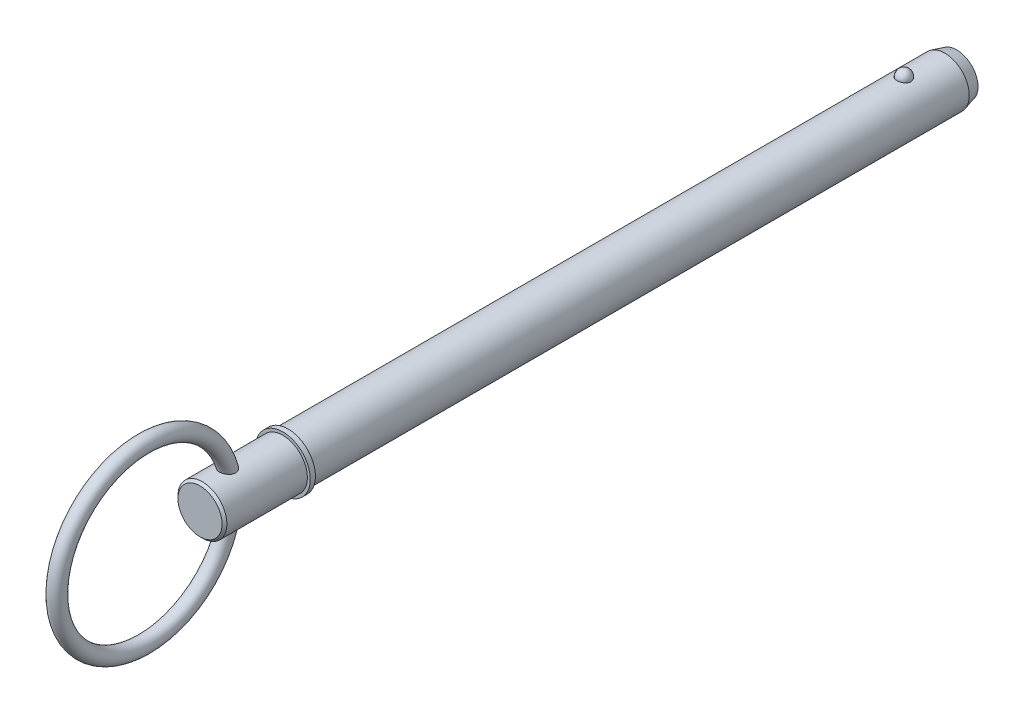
from build123d import *

# Parameters (mm, degrees)
SKETCH2_R           = 7.145
BOSS_EXTRUDE1_DEPTH = 177.8
BOSS_EXTRUDE2_START = 17.45
SKETCH3_R           = 7.145
BOSS_EXTRUDE2_DEPTH = 17.45
CHAMFER1_SIZE       = 3.5
CHAMFER1_SIZE2      = 0.937822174
SKETCH20_W          = 1.5
SKETCH20_H          = 8
SKETCH21_R          = 7.145
BOSS_EXTRUDE3_DEPTH = 25.7
CHAMFER2_SIZE       = 0.7
SKETCH24_R          = 2.25


with BuildPart() as part:
    # Sketch2 → Boss-Extrude1 (new body)
    with BuildSketch(Plane.XY):
        Circle(SKETCH2_R)
    extrude(amount=BOSS_EXTRUDE1_DEPTH)

    # Sketch3 → Boss-Extrude2 (add)
    with BuildSketch(Plane(origin=(0, 0, 0), x_dir=(-1, 0, 0), z_dir=(0, 0, -1)).offset(BOSS_EXTRUDE2_START)):
        Circle(SKETCH3_R)
    extrude(amount=-BOSS_EXTRUDE2_DEPTH)

    # Chamfer1
    chamfer1_edges = [part.edges().sort_by_distance(p)[0] for p in [
        (7.145, 0, -17.45),
    ]]
    chamfer1_side = [part.faces().sort_by_distance(p)[0] for p in [
        (7.145, 0, -8.725),
    ]]
    chamfer(chamfer1_edges, length=CHAMFER1_SIZE, length2=CHAMFER1_SIZE2, reference=chamfer1_side[0])

    # Sketch18 → Revolve1 (revolve)
    with BuildSketch(Plane(origin=(0, 0, 0), x_dir=(0, 0, -1), z_dir=(1, 0, 0))):
        with BuildLine():
            Line((2.02, 9.165), (2.02, 5.125))
            ThreePointArc((2.02, 5.125), (0, 7.145), (2.02, 9.165))
        make_face()
    revolve(axis=Axis((0, 9.165, -2.02), (0, -1, 0)))

    # Sketch20 → Revolve2 (revolve)
    with BuildSketch(Plane(origin=(0, 0, 0), x_dir=(0, 0, -1), z_dir=(1, 0, 0)), mode=Mode.PRIVATE) as revolve2_sk:
        with Locations((-178.55, 4)):
            Rectangle(SKETCH20_W, SKETCH20_H)
    revolve(revolve2_sk.sketch.rotate(Axis((0, 0, 33.728787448), (0, 0, 1)), 90), axis=Axis((0, 0, 33.728787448), (0, 0, 1)))

    # Sketch21 → Boss-Extrude3 (add)
    with BuildSketch(Plane(origin=(0, 0, 177.8), x_dir=(-1, 0, 0), z_dir=(0, 0, -1))):
        Circle(SKETCH21_R)
    extrude(amount=-BOSS_EXTRUDE3_DEPTH)

    # Chamfer2
    chamfer2_edges = [part.edges().sort_by_distance(p)[0] for p in [
        (7.145, 0, 203.5),
    ]]
    chamfer(chamfer2_edges, length=CHAMFER2_SIZE)

    # Sweep1: sweep along a path in Sketch23
    with BuildLine(Plane(origin=(0, 0, 0), x_dir=(0, 0, -1), z_dir=(1, 0, 0))) as sweep1_path:
        CenterArc((-219.9, 0), 25.4, 0, 360)
    # Sketch24 → Sweep1 (sweep)
    with BuildSketch(Plane(origin=(0, 0, 0), x_dir=(1, 0, 0), z_dir=(0, 1, 0))):
        with Locations((0, -194.5)):
            Circle(SKETCH24_R)
    sweep(path=sweep1_path.line)


solid = part.part
